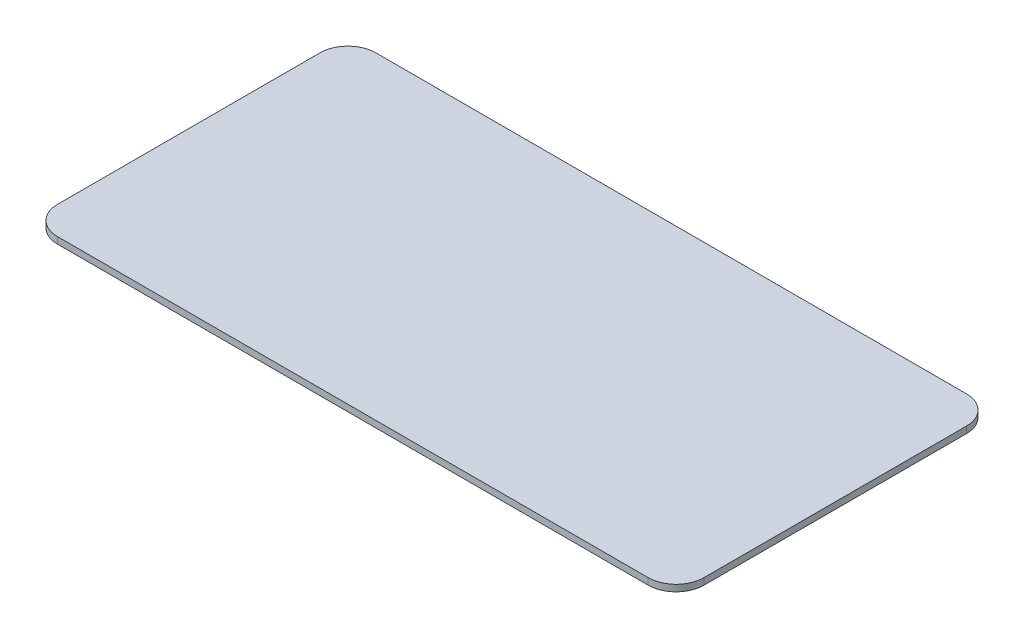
ISO-10303-21;
HEADER;
FILE_DESCRIPTION(('STEP AP214'),'2;1');
FILE_NAME('part.step','',(''),(''),'','','');
FILE_SCHEMA(('AUTOMOTIVE_DESIGN { 1 0 10303 214 1 1 1 1 }'));
ENDSEC;
DATA;
#1=APPLICATION_CONTEXT('core data for automotive mechanical design processes');
#2=APPLICATION_PROTOCOL_DEFINITION('international standard','automotive_design',2000,#1);
#3=PRODUCT_CONTEXT('',#1,'mechanical');
#4=PRODUCT('Part','Part','',(#3));
#5=PRODUCT_RELATED_PRODUCT_CATEGORY('part','',(#4));
#6=PRODUCT_DEFINITION_FORMATION('','',#4);
#7=PRODUCT_DEFINITION_CONTEXT('part definition',#1,'design');
#8=PRODUCT_DEFINITION('design','',#6,#7);
#9=PRODUCT_DEFINITION_SHAPE('','',#8);
#10=(LENGTH_UNIT() NAMED_UNIT(*) SI_UNIT(.MILLI.,.METRE.));
#11=(NAMED_UNIT(*) PLANE_ANGLE_UNIT() SI_UNIT($,.RADIAN.));
#12=(NAMED_UNIT(*) SI_UNIT($,.STERADIAN.) SOLID_ANGLE_UNIT());
#13=UNCERTAINTY_MEASURE_WITH_UNIT(LENGTH_MEASURE(1.E-05),#10,'distance_accuracy_value','');
#14=(GEOMETRIC_REPRESENTATION_CONTEXT(3) GLOBAL_UNCERTAINTY_ASSIGNED_CONTEXT((#13)) GLOBAL_UNIT_ASSIGNED_CONTEXT((#10,
#11,#12)) REPRESENTATION_CONTEXT('',''));
#15=CARTESIAN_POINT('',(0.,0.,0.));
#16=DIRECTION('',(0.,0.,1.));
#17=DIRECTION('',(1.,0.,0.));
#18=AXIS2_PLACEMENT_3D('',#15,#16,#17);
#19=CARTESIAN_POINT('',(-0.79999999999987,8.33666666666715,8.48485577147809));
#20=DIRECTION('',(0.,1.,0.));
#21=DIRECTION('',(0.,0.,-1.));
#22=AXIS2_PLACEMENT_3D('',#19,#20,#21);
#23=PLANE('',#22);
#24=DIRECTION('',(0.,0.,1.));
#25=VECTOR('',#24,1.);
#26=CARTESIAN_POINT('',(-50.05,8.33666666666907,-11.5151442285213));
#27=LINE('',#26,#25);
#28=CARTESIAN_POINT('',(-50.05,8.33666666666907,-11.5151442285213));
#29=VERTEX_POINT('',#28);
#30=CARTESIAN_POINT('',(-50.05,8.33666666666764,28.4848557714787));
#31=VERTEX_POINT('',#30);
#32=EDGE_CURVE('E27',#29,#31,#27,.T.);
#33=ORIENTED_EDGE('',*,*,#32,.T.);
#34=CARTESIAN_POINT('',(-45.8,8.33666666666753,28.4848557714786));
#35=DIRECTION('',(0.,1.,0.));
#36=DIRECTION('',(1.,0.,0.));
#37=AXIS2_PLACEMENT_3D('',#34,#35,#36);
#38=CIRCLE('',#37,4.25);
#39=CARTESIAN_POINT('',(-45.8,8.33666666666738,32.7348557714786));
#40=VERTEX_POINT('',#39);
#41=EDGE_CURVE('E113',#31,#40,#38,.T.);
#42=ORIENTED_EDGE('',*,*,#41,.T.);
#43=DIRECTION('',(1.,0.,0.));
#44=VECTOR('',#43,1.);
#45=CARTESIAN_POINT('',(-45.8,8.33666666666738,32.7348557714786));
#46=LINE('',#45,#44);
#47=CARTESIAN_POINT('',(44.2,8.33666666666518,32.7348557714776));
#48=VERTEX_POINT('',#47);
#49=EDGE_CURVE('E96',#40,#48,#46,.T.);
#50=ORIENTED_EDGE('',*,*,#49,.T.);
#51=CARTESIAN_POINT('',(44.2,8.33666666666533,28.4848557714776));
#52=DIRECTION('',(0.,1.,0.));
#53=DIRECTION('',(1.,0.,0.));
#54=AXIS2_PLACEMENT_3D('',#51,#52,#53);
#55=CIRCLE('',#54,4.25);
#56=CARTESIAN_POINT('',(48.45,8.33666666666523,28.4848557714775));
#57=VERTEX_POINT('',#56);
#58=EDGE_CURVE('E145',#48,#57,#55,.T.);
#59=ORIENTED_EDGE('',*,*,#58,.T.);
#60=DIRECTION('',(0.,0.,-1.));
#61=VECTOR('',#60,1.);
#62=CARTESIAN_POINT('',(48.45,8.33666666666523,28.4848557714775));
#63=LINE('',#62,#61);
#64=CARTESIAN_POINT('',(48.45,8.33666666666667,-11.5151442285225));
#65=VERTEX_POINT('',#64);
#66=EDGE_CURVE('E143',#57,#65,#63,.T.);
#67=ORIENTED_EDGE('',*,*,#66,.T.);
#68=CARTESIAN_POINT('',(44.2,8.33666666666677,-11.5151442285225));
#69=DIRECTION('',(0.,1.,0.));
#70=DIRECTION('',(1.,0.,0.));
#71=AXIS2_PLACEMENT_3D('',#68,#69,#70);
#72=CIRCLE('',#71,4.25);
#73=CARTESIAN_POINT('',(44.2,8.33666666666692,-15.7651442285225));
#74=VERTEX_POINT('',#73);
#75=EDGE_CURVE('E223',#65,#74,#72,.T.);
#76=ORIENTED_EDGE('',*,*,#75,.T.);
#77=DIRECTION('',(-1.,0.,0.));
#78=VECTOR('',#77,1.);
#79=CARTESIAN_POINT('',(44.2,8.33666666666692,-15.7651442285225));
#80=LINE('',#79,#78);
#81=CARTESIAN_POINT('',(-45.8,8.33666666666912,-15.7651442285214));
#82=VERTEX_POINT('',#81);
#83=EDGE_CURVE('E134',#74,#82,#80,.T.);
#84=ORIENTED_EDGE('',*,*,#83,.T.);
#85=CARTESIAN_POINT('',(-45.8,8.33666666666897,-11.5151442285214));
#86=DIRECTION('',(0.,1.,0.));
#87=DIRECTION('',(1.,0.,0.));
#88=AXIS2_PLACEMENT_3D('',#85,#86,#87);
#89=CIRCLE('',#88,4.25);
#90=EDGE_CURVE('E138',#82,#29,#89,.T.);
#91=ORIENTED_EDGE('',*,*,#90,.T.);
#92=EDGE_LOOP('',(#33,#42,#50,#59,#67,#76,#84,#91));
#93=FACE_BOUND('',#92,.T.);
#94=ADVANCED_FACE('F16',(#93),#23,.T.);
#95=CARTESIAN_POINT('',(-45.8,7.33666666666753,28.4848557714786));
#96=DIRECTION('',(0.,1.,0.));
#97=DIRECTION('',(0.,0.,-1.));
#98=AXIS2_PLACEMENT_3D('',#95,#96,#97);
#99=PLANE('',#98);
#100=CARTESIAN_POINT('',(-45.8,7.33666666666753,28.4848557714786));
#101=DIRECTION('',(0.,1.,0.));
#102=DIRECTION('',(1.,0.,0.));
#103=AXIS2_PLACEMENT_3D('',#100,#101,#102);
#104=CIRCLE('',#103,4.25);
#105=CARTESIAN_POINT('',(-50.05,7.33666666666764,28.4848557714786));
#106=VERTEX_POINT('',#105);
#107=CARTESIAN_POINT('',(-45.8,7.33666666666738,32.7348557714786));
#108=VERTEX_POINT('',#107);
#109=EDGE_CURVE('E114',#106,#108,#104,.T.);
#110=ORIENTED_EDGE('',*,*,#109,.F.);
#111=DIRECTION('',(0.,0.,1.));
#112=VECTOR('',#111,1.);
#113=CARTESIAN_POINT('',(-50.05,7.33666666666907,-11.5151442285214));
#114=LINE('',#113,#112);
#115=CARTESIAN_POINT('',(-50.05,7.33666666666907,-11.5151442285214));
#116=VERTEX_POINT('',#115);
#117=EDGE_CURVE('E11',#116,#106,#114,.T.);
#118=ORIENTED_EDGE('',*,*,#117,.F.);
#119=CARTESIAN_POINT('',(-45.8,7.33666666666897,-11.5151442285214));
#120=DIRECTION('',(0.,1.,0.));
#121=DIRECTION('',(1.,0.,0.));
#122=AXIS2_PLACEMENT_3D('',#119,#120,#121);
#123=CIRCLE('',#122,4.25);
#124=CARTESIAN_POINT('',(-45.8,7.33666666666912,-15.7651442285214));
#125=VERTEX_POINT('',#124);
#126=EDGE_CURVE('E150',#125,#116,#123,.T.);
#127=ORIENTED_EDGE('',*,*,#126,.F.);
#128=DIRECTION('',(-1.,0.,0.));
#129=VECTOR('',#128,1.);
#130=CARTESIAN_POINT('',(44.2,7.33666666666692,-15.7651442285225));
#131=LINE('',#130,#129);
#132=CARTESIAN_POINT('',(44.2,7.33666666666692,-15.7651442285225));
#133=VERTEX_POINT('',#132);
#134=EDGE_CURVE('E129',#133,#125,#131,.T.);
#135=ORIENTED_EDGE('',*,*,#134,.F.);
#136=CARTESIAN_POINT('',(44.2,7.33666666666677,-11.5151442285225));
#137=DIRECTION('',(0.,1.,0.));
#138=DIRECTION('',(1.,0.,0.));
#139=AXIS2_PLACEMENT_3D('',#136,#137,#138);
#140=CIRCLE('',#139,4.25);
#141=CARTESIAN_POINT('',(48.45,7.33666666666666,-11.5151442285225));
#142=VERTEX_POINT('',#141);
#143=EDGE_CURVE('E218',#142,#133,#140,.T.);
#144=ORIENTED_EDGE('',*,*,#143,.F.);
#145=DIRECTION('',(0.,0.,-1.));
#146=VECTOR('',#145,1.);
#147=CARTESIAN_POINT('',(48.45,7.33666666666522,28.4848557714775));
#148=LINE('',#147,#146);
#149=CARTESIAN_POINT('',(48.45,7.33666666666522,28.4848557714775));
#150=VERTEX_POINT('',#149);
#151=EDGE_CURVE('E237',#150,#142,#148,.T.);
#152=ORIENTED_EDGE('',*,*,#151,.F.);
#153=CARTESIAN_POINT('',(44.2,7.33666666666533,28.4848557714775));
#154=DIRECTION('',(0.,1.,0.));
#155=DIRECTION('',(1.,0.,0.));
#156=AXIS2_PLACEMENT_3D('',#153,#154,#155);
#157=CIRCLE('',#156,4.25);
#158=CARTESIAN_POINT('',(44.2,7.33666666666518,32.7348557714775));
#159=VERTEX_POINT('',#158);
#160=EDGE_CURVE('E144',#159,#150,#157,.T.);
#161=ORIENTED_EDGE('',*,*,#160,.F.);
#162=DIRECTION('',(1.,0.,0.));
#163=VECTOR('',#162,1.);
#164=CARTESIAN_POINT('',(-45.8,7.33666666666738,32.7348557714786));
#165=LINE('',#164,#163);
#166=EDGE_CURVE('E108',#108,#159,#165,.T.);
#167=ORIENTED_EDGE('',*,*,#166,.F.);
#168=EDGE_LOOP('',(#110,#118,#127,#135,#144,#152,#161,#167));
#169=FACE_BOUND('',#168,.T.);
#170=ADVANCED_FACE('F264',(#169),#99,.F.);
#171=CARTESIAN_POINT('',(-50.0499999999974,118.129653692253,-11.5151442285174));
#172=DIRECTION('',(1.,0.,0.));
#173=DIRECTION('',(0.,-1.,0.));
#174=AXIS2_PLACEMENT_3D('',#171,#172,#173);
#175=PLANE('',#174);
#176=ORIENTED_EDGE('',*,*,#32,.F.);
#177=DIRECTION('',(0.,-1.,0.));
#178=VECTOR('',#177,1.);
#179=CARTESIAN_POINT('',(-50.0499999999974,118.129653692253,-11.5151442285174));
#180=LINE('',#179,#178);
#181=EDGE_CURVE('E20',#29,#116,#180,.T.);
#182=ORIENTED_EDGE('',*,*,#181,.T.);
#183=ORIENTED_EDGE('',*,*,#117,.T.);
#184=DIRECTION('',(0.,-1.,0.));
#185=VECTOR('',#184,1.);
#186=CARTESIAN_POINT('',(-50.0499999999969,118.129653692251,28.4848557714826));
#187=LINE('',#186,#185);
#188=EDGE_CURVE('E120',#31,#106,#187,.T.);
#189=ORIENTED_EDGE('',*,*,#188,.F.);
#190=EDGE_LOOP('',(#176,#182,#183,#189));
#191=FACE_BOUND('',#190,.T.);
#192=ADVANCED_FACE('F322',(#191),#175,.F.);
#193=CARTESIAN_POINT('',(-45.7999999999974,118.129653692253,-11.5151442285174));
#194=DIRECTION('',(0.,-1.,0.));
#195=DIRECTION('',(-1.,0.,0.));
#196=AXIS2_PLACEMENT_3D('',#193,#194,#195);
#197=CYLINDRICAL_SURFACE('',#196,4.25);
#198=ORIENTED_EDGE('',*,*,#90,.F.);
#199=DIRECTION('',(0.,-1.,0.));
#200=VECTOR('',#199,1.);
#201=CARTESIAN_POINT('',(-45.7999999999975,118.129653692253,-15.7651442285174));
#202=LINE('',#201,#200);
#203=EDGE_CURVE('E133',#82,#125,#202,.T.);
#204=ORIENTED_EDGE('',*,*,#203,.T.);
#205=ORIENTED_EDGE('',*,*,#126,.T.);
#206=ORIENTED_EDGE('',*,*,#181,.F.);
#207=EDGE_LOOP('',(#198,#204,#205,#206));
#208=FACE_BOUND('',#207,.T.);
#209=ADVANCED_FACE('F282',(#208),#197,.T.);
#210=CARTESIAN_POINT('',(44.2000000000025,118.129653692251,-15.7651442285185));
#211=DIRECTION('',(0.,0.,1.));
#212=DIRECTION('',(0.,-1.,0.));
#213=AXIS2_PLACEMENT_3D('',#210,#211,#212);
#214=PLANE('',#213);
#215=ORIENTED_EDGE('',*,*,#83,.F.);
#216=DIRECTION('',(0.,-1.,0.));
#217=VECTOR('',#216,1.);
#218=CARTESIAN_POINT('',(44.2000000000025,118.129653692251,-15.7651442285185));
#219=LINE('',#218,#217);
#220=EDGE_CURVE('E215',#74,#133,#219,.T.);
#221=ORIENTED_EDGE('',*,*,#220,.T.);
#222=ORIENTED_EDGE('',*,*,#134,.T.);
#223=ORIENTED_EDGE('',*,*,#203,.F.);
#224=EDGE_LOOP('',(#215,#221,#222,#223));
#225=FACE_BOUND('',#224,.T.);
#226=ADVANCED_FACE('F276',(#225),#214,.F.);
#227=CARTESIAN_POINT('',(44.2000000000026,118.129653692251,-11.5151442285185));
#228=DIRECTION('',(0.,-1.,0.));
#229=DIRECTION('',(-1.,0.,0.));
#230=AXIS2_PLACEMENT_3D('',#227,#228,#229);
#231=CYLINDRICAL_SURFACE('',#230,4.25);
#232=ORIENTED_EDGE('',*,*,#75,.F.);
#233=DIRECTION('',(0.,-1.,0.));
#234=VECTOR('',#233,1.);
#235=CARTESIAN_POINT('',(48.4500000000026,118.129653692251,-11.5151442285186));
#236=LINE('',#235,#234);
#237=EDGE_CURVE('E230',#65,#142,#236,.T.);
#238=ORIENTED_EDGE('',*,*,#237,.T.);
#239=ORIENTED_EDGE('',*,*,#143,.T.);
#240=ORIENTED_EDGE('',*,*,#220,.F.);
#241=EDGE_LOOP('',(#232,#238,#239,#240));
#242=FACE_BOUND('',#241,.T.);
#243=ADVANCED_FACE('F274',(#242),#231,.T.);
#244=CARTESIAN_POINT('',(48.4500000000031,118.129653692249,28.4848557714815));
#245=DIRECTION('',(-1.,0.,0.));
#246=DIRECTION('',(0.,0.,1.));
#247=AXIS2_PLACEMENT_3D('',#244,#245,#246);
#248=PLANE('',#247);
#249=ORIENTED_EDGE('',*,*,#66,.F.);
#250=DIRECTION('',(0.,-1.,0.));
#251=VECTOR('',#250,1.);
#252=CARTESIAN_POINT('',(48.4500000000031,118.129653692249,28.4848557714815));
#253=LINE('',#252,#251);
#254=EDGE_CURVE('E139',#57,#150,#253,.T.);
#255=ORIENTED_EDGE('',*,*,#254,.T.);
#256=ORIENTED_EDGE('',*,*,#151,.T.);
#257=ORIENTED_EDGE('',*,*,#237,.F.);
#258=EDGE_LOOP('',(#249,#255,#256,#257));
#259=FACE_BOUND('',#258,.T.);
#260=ADVANCED_FACE('F268',(#259),#248,.F.);
#261=CARTESIAN_POINT('',(44.2000000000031,118.129653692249,28.4848557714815));
#262=DIRECTION('',(0.,-1.,0.));
#263=DIRECTION('',(-1.,0.,0.));
#264=AXIS2_PLACEMENT_3D('',#261,#262,#263);
#265=CYLINDRICAL_SURFACE('',#264,4.25);
#266=ORIENTED_EDGE('',*,*,#58,.F.);
#267=DIRECTION('',(0.,-1.,0.));
#268=VECTOR('',#267,1.);
#269=CARTESIAN_POINT('',(44.2000000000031,118.129653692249,32.7348557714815));
#270=LINE('',#269,#268);
#271=EDGE_CURVE('E103',#48,#159,#270,.T.);
#272=ORIENTED_EDGE('',*,*,#271,.T.);
#273=ORIENTED_EDGE('',*,*,#160,.T.);
#274=ORIENTED_EDGE('',*,*,#254,.F.);
#275=EDGE_LOOP('',(#266,#272,#273,#274));
#276=FACE_BOUND('',#275,.T.);
#277=ADVANCED_FACE('F263',(#276),#265,.T.);
#278=CARTESIAN_POINT('',(-45.7999999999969,118.129653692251,32.7348557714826));
#279=DIRECTION('',(0.,0.,-1.));
#280=DIRECTION('',(-1.,0.,0.));
#281=AXIS2_PLACEMENT_3D('',#278,#279,#280);
#282=PLANE('',#281);
#283=ORIENTED_EDGE('',*,*,#49,.F.);
#284=DIRECTION('',(0.,-1.,0.));
#285=VECTOR('',#284,1.);
#286=CARTESIAN_POINT('',(-45.7999999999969,118.129653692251,32.7348557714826));
#287=LINE('',#286,#285);
#288=EDGE_CURVE('E100',#40,#108,#287,.T.);
#289=ORIENTED_EDGE('',*,*,#288,.T.);
#290=ORIENTED_EDGE('',*,*,#166,.T.);
#291=ORIENTED_EDGE('',*,*,#271,.F.);
#292=EDGE_LOOP('',(#283,#289,#290,#291));
#293=FACE_BOUND('',#292,.T.);
#294=ADVANCED_FACE('F98',(#293),#282,.F.);
#295=CARTESIAN_POINT('',(-45.7999999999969,118.129653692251,28.4848557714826));
#296=DIRECTION('',(0.,-1.,0.));
#297=DIRECTION('',(-1.,0.,0.));
#298=AXIS2_PLACEMENT_3D('',#295,#296,#297);
#299=CYLINDRICAL_SURFACE('',#298,4.25);
#300=ORIENTED_EDGE('',*,*,#41,.F.);
#301=ORIENTED_EDGE('',*,*,#188,.T.);
#302=ORIENTED_EDGE('',*,*,#109,.T.);
#303=ORIENTED_EDGE('',*,*,#288,.F.);
#304=EDGE_LOOP('',(#300,#301,#302,#303));
#305=FACE_BOUND('',#304,.T.);
#306=ADVANCED_FACE('F18',(#305),#299,.T.);
#307=CLOSED_SHELL('',(#94,#170,#192,#209,#226,#243,#260,#277,#294,#306));
#308=MANIFOLD_SOLID_BREP('B1',#307);
#309=ADVANCED_BREP_SHAPE_REPRESENTATION('',(#18,#308),#14);
#310=SHAPE_DEFINITION_REPRESENTATION(#9,#309);
ENDSEC;
END-ISO-10303-21;
